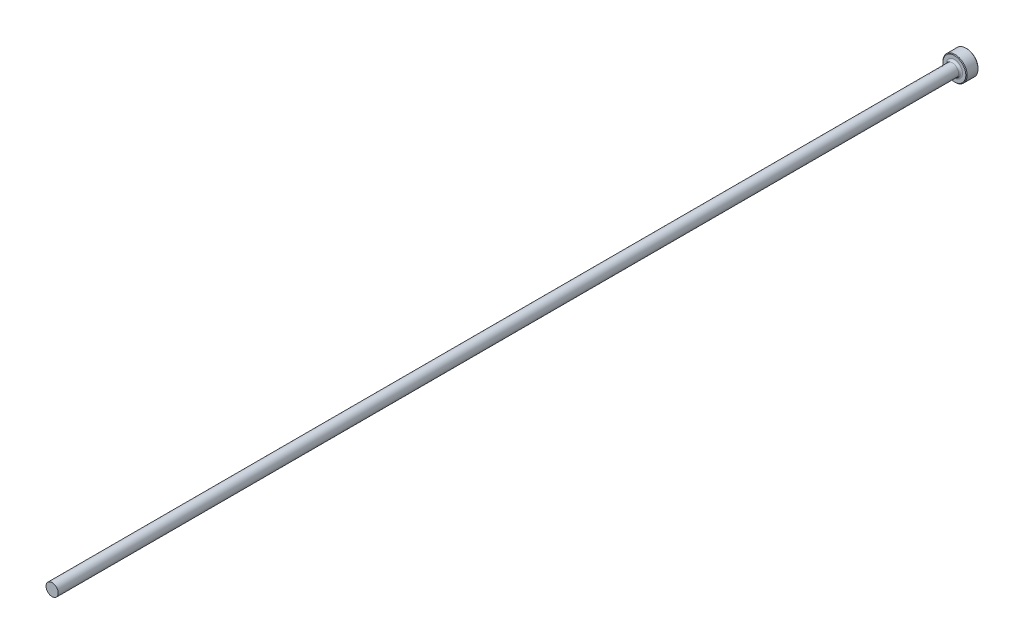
from build123d import *

# Parameters (mm, degrees)
CHAMFER1_SIZE = 0.254


with BuildPart() as part:
    # Sketch1 → Revolve1 (revolve)
    with BuildSketch(Plane(origin=(0, 0, 0), x_dir=(0, 0, -1), z_dir=(1, 0, 0)), mode=Mode.PRIVATE) as revolve1_sk:
        with BuildLine():
            Line((0, 0), (0, 4.699))
            Line((0, 4.699), (-4.7498, 4.699))
            Line((-4.7498, 4.699), (-4.7498, 3.14325))
            ThreePointArc((-4.7498, 3.14325), (-4.972984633, 2.604434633), (-5.5118, 2.38125))
            Line((-5.5118, 2.38125), (-355.6, 2.38125))
            Line((-355.6, 2.38125), (-355.6, 0))
            Line((-355.6, 0), (0, 0))
        make_face()
    revolve(revolve1_sk.sketch.rotate(Axis((0, 0, -25.434744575), (0, 0, 1)), 90), axis=Axis((0, 0, -25.434744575), (0, 0, 1)))

    # Chamfer1
    chamfer1_edges = [part.edges().sort_by_distance(p)[0] for p in [
        (4.699, 0, 0),
        (4.699, 0, 4.7498),
    ]]
    chamfer(chamfer1_edges, length=CHAMFER1_SIZE)


solid = part.part
